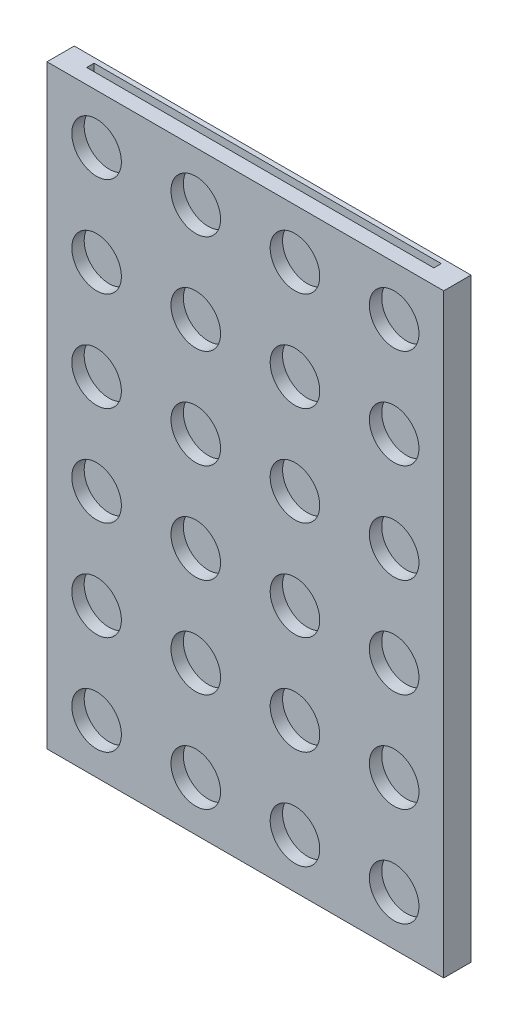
from build123d import *

# Parameters (mm, degrees)
SKETCH1_W           = 101.6
SKETCH1_H           = 152.4
BOSS_EXTRUDE1_DEPTH = 6.985
SKETCH3_R           = 6.35
CUT_EXTRUDE2_DEPTH  = 3.175
SKETCH5_W           = 88.9
SKETCH5_H           = 1.905
CUT_EXTRUDE3_DEPTH  = 146.05
SKETCH4_W           = 86.36
SKETCH4_H           = 137.16
CUT_EXTRUDE4_DEPTH  = 2.54


with BuildPart() as part:
    # Sketch1 → Boss-Extrude1 (new body)
    with BuildSketch(Plane.XY):
        with Locations((50.8, 76.2)):
            Rectangle(SKETCH1_W, SKETCH1_H)
    extrude(amount=BOSS_EXTRUDE1_DEPTH)

    # Sketch3 → Cut-Extrude2 (cut)
    with BuildSketch(Plane.XY.offset(6.985)):
        with Locations((12.7, 139.7)):
            Circle(SKETCH3_R)
        with Locations((38.1, 139.7)):
            Circle(SKETCH3_R)
        with Locations((63.5, 139.7)):
            Circle(SKETCH3_R)
        with Locations((88.9, 139.7)):
            Circle(SKETCH3_R)
        with Locations(Location((88.9, 114.3, 0), (0, 0, 180))):
            Circle(SKETCH3_R)
        with Locations(Location((63.5, 114.3, 0), (0, 0, 180))):
            Circle(SKETCH3_R)
        with Locations(Location((38.1, 114.3, 0), (0, 0, 180))):
            Circle(SKETCH3_R)
        with Locations(Location((12.7, 114.3, 0), (0, 0, 180))):
            Circle(SKETCH3_R)
        with Locations((88.9, 88.9)):
            Circle(SKETCH3_R)
        with Locations((63.5, 88.9)):
            Circle(SKETCH3_R)
        with Locations((38.1, 88.9)):
            Circle(SKETCH3_R)
        with Locations((12.7, 88.9)):
            Circle(SKETCH3_R)
        with Locations(Location((88.9, 63.5, 0), (0, 0, 180))):
            Circle(SKETCH3_R)
        with Locations(Location((63.5, 63.5, 0), (0, 0, 180))):
            Circle(SKETCH3_R)
        with Locations(Location((38.1, 63.5, 0), (0, 0, 180))):
            Circle(SKETCH3_R)
        with Locations(Location((12.7, 63.5, 0), (0, 0, 180))):
            Circle(SKETCH3_R)
        with Locations((88.9, 38.1)):
            Circle(SKETCH3_R)
        with Locations((63.5, 38.1)):
            Circle(SKETCH3_R)
        with Locations((38.1, 38.1)):
            Circle(SKETCH3_R)
        with Locations((12.7, 38.1)):
            Circle(SKETCH3_R)
        with Locations(Location((88.9, 12.7, 0), (0, 0, 180))):
            Circle(SKETCH3_R)
        with Locations(Location((63.5, 12.7, 0), (0, 0, 180))):
            Circle(SKETCH3_R)
        with Locations(Location((38.1, 12.7, 0), (0, 0, 180))):
            Circle(SKETCH3_R)
        with Locations(Location((12.7, 12.7, 0), (0, 0, 180))):
            Circle(SKETCH3_R)
    extrude(amount=-CUT_EXTRUDE2_DEPTH, mode=Mode.SUBTRACT)

    # Sketch5 → Cut-Extrude3 (cut)
    with BuildSketch(Plane(origin=(0, 152.4, 0), x_dir=(1, 0, 0), z_dir=(0, 1, 0))):
        with Locations((50.8, -2.2225)):
            Rectangle(SKETCH5_W, SKETCH5_H)
    extrude(amount=-CUT_EXTRUDE3_DEPTH, mode=Mode.SUBTRACT)

    # Sketch4 → Cut-Extrude4 (cut)
    with BuildSketch(Plane(origin=(0, 0, 0), x_dir=(-1, 0, 0), z_dir=(0, 0, -1))):
        with Locations((-50.8, 76.2)):
            Rectangle(SKETCH4_W, SKETCH4_H)
    extrude(amount=-CUT_EXTRUDE4_DEPTH, mode=Mode.SUBTRACT)


solid = part.part
